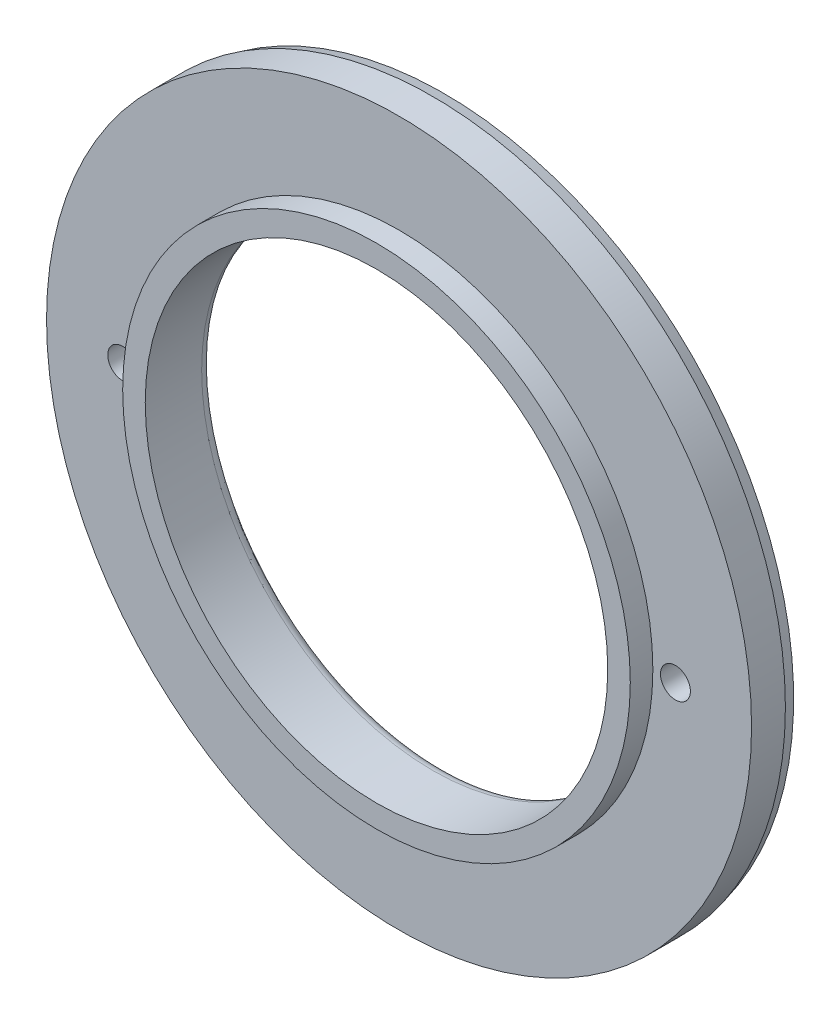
ISO-10303-21;
HEADER;
FILE_DESCRIPTION(('STEP AP214'),'2;1');
FILE_NAME('part.step','',(''),(''),'','','');
FILE_SCHEMA(('AUTOMOTIVE_DESIGN { 1 0 10303 214 1 1 1 1 }'));
ENDSEC;
DATA;
#1=APPLICATION_CONTEXT('core data for automotive mechanical design processes');
#2=APPLICATION_PROTOCOL_DEFINITION('international standard','automotive_design',2000,#1);
#3=PRODUCT_CONTEXT('',#1,'mechanical');
#4=PRODUCT('Part','Part','',(#3));
#5=PRODUCT_RELATED_PRODUCT_CATEGORY('part','',(#4));
#6=PRODUCT_DEFINITION_FORMATION('','',#4);
#7=PRODUCT_DEFINITION_CONTEXT('part definition',#1,'design');
#8=PRODUCT_DEFINITION('design','',#6,#7);
#9=PRODUCT_DEFINITION_SHAPE('','',#8);
#10=(LENGTH_UNIT() NAMED_UNIT(*) SI_UNIT(.MILLI.,.METRE.));
#11=(NAMED_UNIT(*) PLANE_ANGLE_UNIT() SI_UNIT($,.RADIAN.));
#12=(NAMED_UNIT(*) SI_UNIT($,.STERADIAN.) SOLID_ANGLE_UNIT());
#13=UNCERTAINTY_MEASURE_WITH_UNIT(LENGTH_MEASURE(1.E-05),#10,'distance_accuracy_value','');
#14=(GEOMETRIC_REPRESENTATION_CONTEXT(3) GLOBAL_UNCERTAINTY_ASSIGNED_CONTEXT((#13)) GLOBAL_UNIT_ASSIGNED_CONTEXT((#10,
#11,#12)) REPRESENTATION_CONTEXT('',''));
#15=CARTESIAN_POINT('',(0.,0.,0.));
#16=DIRECTION('',(0.,0.,1.));
#17=DIRECTION('',(1.,0.,0.));
#18=AXIS2_PLACEMENT_3D('',#15,#16,#17);
#19=CARTESIAN_POINT('',(0.,0.,16.));
#20=DIRECTION('',(0.,0.,-1.));
#21=DIRECTION('',(1.,0.,0.));
#22=AXIS2_PLACEMENT_3D('',#19,#20,#21);
#23=CYLINDRICAL_SURFACE('',#22,62.5);
#24=CARTESIAN_POINT('',(0.,0.,10.0000000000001));
#25=DIRECTION('',(0.,0.,-1.));
#26=DIRECTION('',(-1.,0.,0.));
#27=AXIS2_PLACEMENT_3D('',#24,#25,#26);
#28=CIRCLE('',#27,62.5);
#29=CARTESIAN_POINT('',(-62.5,0.,10.0000000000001));
#30=VERTEX_POINT('',#29);
#31=EDGE_CURVE('E36',#30,#30,#28,.T.);
#32=ORIENTED_EDGE('',*,*,#31,.F.);
#33=EDGE_LOOP('',(#32));
#34=FACE_BOUND('',#33,.T.);
#35=CARTESIAN_POINT('',(0.,0.,16.));
#36=DIRECTION('',(0.,0.,1.));
#37=DIRECTION('',(1.,0.,0.));
#38=AXIS2_PLACEMENT_3D('',#35,#36,#37);
#39=CIRCLE('',#38,62.5);
#40=CARTESIAN_POINT('',(62.5,0.,16.));
#41=VERTEX_POINT('',#40);
#42=EDGE_CURVE('E62',#41,#41,#39,.T.);
#43=ORIENTED_EDGE('',*,*,#42,.F.);
#44=EDGE_LOOP('',(#43));
#45=FACE_BOUND('',#44,.T.);
#46=ADVANCED_FACE('F24',(#34,#45),#23,.T.);
#47=CARTESIAN_POINT('',(0.,62.5,16.));
#48=DIRECTION('',(0.,0.,-1.));
#49=DIRECTION('',(1.,0.,0.));
#50=AXIS2_PLACEMENT_3D('',#47,#48,#49);
#51=PLANE('',#50);
#52=CARTESIAN_POINT('',(-49.,0.,16.));
#53=DIRECTION('',(0.,0.,1.));
#54=DIRECTION('',(1.,0.,0.));
#55=AXIS2_PLACEMENT_3D('',#52,#53,#54);
#56=CIRCLE('',#55,2.64999999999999);
#57=CARTESIAN_POINT('',(-46.35,0.,16.));
#58=VERTEX_POINT('',#57);
#59=EDGE_CURVE('E27',#58,#58,#56,.T.);
#60=ORIENTED_EDGE('',*,*,#59,.F.);
#61=EDGE_LOOP('',(#60));
#62=FACE_BOUND('',#61,.T.);
#63=CARTESIAN_POINT('',(49.,0.,16.));
#64=DIRECTION('',(0.,0.,1.));
#65=DIRECTION('',(1.,0.,0.));
#66=AXIS2_PLACEMENT_3D('',#63,#64,#65);
#67=CIRCLE('',#66,2.64999999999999);
#68=CARTESIAN_POINT('',(51.65,0.,16.));
#69=VERTEX_POINT('',#68);
#70=EDGE_CURVE('E39',#69,#69,#67,.T.);
#71=ORIENTED_EDGE('',*,*,#70,.F.);
#72=EDGE_LOOP('',(#71));
#73=FACE_BOUND('',#72,.T.);
#74=ORIENTED_EDGE('',*,*,#42,.T.);
#75=EDGE_LOOP('',(#74));
#76=FACE_BOUND('',#75,.T.);
#77=CARTESIAN_POINT('',(0.,0.,16.));
#78=DIRECTION('',(0.,0.,1.));
#79=DIRECTION('',(1.,0.,0.));
#80=AXIS2_PLACEMENT_3D('',#77,#78,#79);
#81=CIRCLE('',#80,45.);
#82=CARTESIAN_POINT('',(45.,0.,16.));
#83=VERTEX_POINT('',#82);
#84=EDGE_CURVE('E59',#83,#83,#81,.T.);
#85=ORIENTED_EDGE('',*,*,#84,.F.);
#86=EDGE_LOOP('',(#85));
#87=FACE_BOUND('',#86,.T.);
#88=ADVANCED_FACE('F75',(#62,#73,#76,#87),#51,.F.);
#89=CARTESIAN_POINT('',(0.,0.,16.));
#90=DIRECTION('',(0.,0.,-1.));
#91=DIRECTION('',(1.,0.,0.));
#92=AXIS2_PLACEMENT_3D('',#89,#90,#91);
#93=CYLINDRICAL_SURFACE('',#92,45.);
#94=ORIENTED_EDGE('',*,*,#84,.T.);
#95=EDGE_LOOP('',(#94));
#96=FACE_BOUND('',#95,.T.);
#97=CARTESIAN_POINT('',(0.,0.,20.));
#98=DIRECTION('',(0.,0.,1.));
#99=DIRECTION('',(1.,0.,0.));
#100=AXIS2_PLACEMENT_3D('',#97,#98,#99);
#101=CIRCLE('',#100,45.);
#102=CARTESIAN_POINT('',(45.,0.,20.));
#103=VERTEX_POINT('',#102);
#104=EDGE_CURVE('E46',#103,#103,#101,.T.);
#105=ORIENTED_EDGE('',*,*,#104,.F.);
#106=EDGE_LOOP('',(#105));
#107=FACE_BOUND('',#106,.T.);
#108=ADVANCED_FACE('F80',(#96,#107),#93,.T.);
#109=CARTESIAN_POINT('',(0.,41.,20.));
#110=DIRECTION('',(0.,0.,-1.));
#111=DIRECTION('',(1.,0.,0.));
#112=AXIS2_PLACEMENT_3D('',#109,#110,#111);
#113=PLANE('',#112);
#114=ORIENTED_EDGE('',*,*,#104,.T.);
#115=EDGE_LOOP('',(#114));
#116=FACE_BOUND('',#115,.T.);
#117=CARTESIAN_POINT('',(0.,0.,20.));
#118=DIRECTION('',(0.,0.,1.));
#119=DIRECTION('',(1.,0.,0.));
#120=AXIS2_PLACEMENT_3D('',#117,#118,#119);
#121=CIRCLE('',#120,41.);
#122=CARTESIAN_POINT('',(41.,0.,20.));
#123=VERTEX_POINT('',#122);
#124=EDGE_CURVE('E41',#123,#123,#121,.T.);
#125=ORIENTED_EDGE('',*,*,#124,.F.);
#126=EDGE_LOOP('',(#125));
#127=FACE_BOUND('',#126,.T.);
#128=ADVANCED_FACE('F86',(#116,#127),#113,.F.);
#129=CARTESIAN_POINT('',(0.,0.,16.));
#130=DIRECTION('',(0.,0.,-1.));
#131=DIRECTION('',(1.,0.,0.));
#132=AXIS2_PLACEMENT_3D('',#129,#130,#131);
#133=CYLINDRICAL_SURFACE('',#132,41.);
#134=CARTESIAN_POINT('',(0.,0.,10.));
#135=DIRECTION('',(0.,0.,-1.));
#136=DIRECTION('',(-1.,0.,0.));
#137=AXIS2_PLACEMENT_3D('',#134,#135,#136);
#138=CIRCLE('',#137,41.);
#139=CARTESIAN_POINT('',(-41.,0.,10.));
#140=VERTEX_POINT('',#139);
#141=EDGE_CURVE('E31',#140,#140,#138,.F.);
#142=ORIENTED_EDGE('',*,*,#141,.F.);
#143=EDGE_LOOP('',(#142));
#144=FACE_BOUND('',#143,.T.);
#145=ORIENTED_EDGE('',*,*,#124,.T.);
#146=EDGE_LOOP('',(#145));
#147=FACE_BOUND('',#146,.T.);
#148=ADVANCED_FACE('F92',(#144,#147),#133,.F.);
#149=CARTESIAN_POINT('',(0.,62.5,8.));
#150=DIRECTION('',(0.,0.,1.));
#151=DIRECTION('',(-1.,0.,0.));
#152=AXIS2_PLACEMENT_3D('',#149,#150,#151);
#153=PLANE('',#152);
#154=CARTESIAN_POINT('',(-49.,0.,8.));
#155=DIRECTION('',(0.,0.,1.));
#156=DIRECTION('',(1.,0.,0.));
#157=AXIS2_PLACEMENT_3D('',#154,#155,#156);
#158=CIRCLE('',#157,5.2);
#159=CARTESIAN_POINT('',(-43.8,0.,8.));
#160=VERTEX_POINT('',#159);
#161=EDGE_CURVE('E135',#160,#160,#158,.T.);
#162=ORIENTED_EDGE('',*,*,#161,.T.);
#163=EDGE_LOOP('',(#162));
#164=FACE_BOUND('',#163,.T.);
#165=CARTESIAN_POINT('',(49.,0.,8.));
#166=DIRECTION('',(0.,0.,1.));
#167=DIRECTION('',(1.,0.,0.));
#168=AXIS2_PLACEMENT_3D('',#165,#166,#167);
#169=CIRCLE('',#168,5.2);
#170=CARTESIAN_POINT('',(54.2,0.,8.));
#171=VERTEX_POINT('',#170);
#172=EDGE_CURVE('E42',#171,#171,#169,.T.);
#173=ORIENTED_EDGE('',*,*,#172,.T.);
#174=EDGE_LOOP('',(#173));
#175=FACE_BOUND('',#174,.T.);
#176=CARTESIAN_POINT('',(0.,0.,8.));
#177=DIRECTION('',(0.,0.,-1.));
#178=DIRECTION('',(-1.,0.,0.));
#179=AXIS2_PLACEMENT_3D('',#176,#177,#178);
#180=CIRCLE('',#179,43.);
#181=CARTESIAN_POINT('',(-43.,0.,8.));
#182=VERTEX_POINT('',#181);
#183=EDGE_CURVE('E10',#182,#182,#180,.T.);
#184=ORIENTED_EDGE('',*,*,#183,.F.);
#185=EDGE_LOOP('',(#184));
#186=FACE_BOUND('',#185,.T.);
#187=CARTESIAN_POINT('',(0.,0.,8.));
#188=DIRECTION('',(0.,0.,-1.));
#189=DIRECTION('',(-1.,0.,0.));
#190=AXIS2_PLACEMENT_3D('',#187,#188,#189);
#191=CIRCLE('',#190,61.9641016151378);
#192=CARTESIAN_POINT('',(-61.9641016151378,0.,8.));
#193=VERTEX_POINT('',#192);
#194=EDGE_CURVE('E65',#193,#193,#191,.F.);
#195=ORIENTED_EDGE('',*,*,#194,.F.);
#196=EDGE_LOOP('',(#195));
#197=FACE_BOUND('',#196,.T.);
#198=ADVANCED_FACE('F97',(#164,#175,#186,#197),#153,.F.);
#199=CARTESIAN_POINT('',(0.,0.,8.));
#200=DIRECTION('',(0.,0.,1.));
#201=DIRECTION('',(-1.,0.,0.));
#202=AXIS2_PLACEMENT_3D('',#199,#200,#201);
#203=CONICAL_SURFACE('',#202,61.9641016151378,0.261799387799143);
#204=ORIENTED_EDGE('',*,*,#31,.T.);
#205=EDGE_LOOP('',(#204));
#206=FACE_BOUND('',#205,.T.);
#207=ORIENTED_EDGE('',*,*,#194,.T.);
#208=EDGE_LOOP('',(#207));
#209=FACE_BOUND('',#208,.T.);
#210=ADVANCED_FACE('F70',(#206,#209),#203,.T.);
#211=CARTESIAN_POINT('',(0.,0.,10.));
#212=DIRECTION('',(0.,0.,1.));
#213=DIRECTION('',(-1.,0.,0.));
#214=AXIS2_PLACEMENT_3D('',#211,#212,#213);
#215=TOROIDAL_SURFACE('',#214,43.,2.);
#216=ORIENTED_EDGE('',*,*,#183,.T.);
#217=EDGE_LOOP('',(#216));
#218=FACE_BOUND('',#217,.T.);
#219=ORIENTED_EDGE('',*,*,#141,.T.);
#220=EDGE_LOOP('',(#219));
#221=FACE_BOUND('',#220,.T.);
#222=ADVANCED_FACE('F109',(#218,#221),#215,.T.);
#223=CARTESIAN_POINT('',(49.,0.,8.));
#224=DIRECTION('',(0.,0.,-1.));
#225=DIRECTION('',(1.,0.,0.));
#226=AXIS2_PLACEMENT_3D('',#223,#224,#225);
#227=CYLINDRICAL_SURFACE('',#226,2.64999999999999);
#228=CARTESIAN_POINT('',(49.,0.,10.55));
#229=DIRECTION('',(0.,0.,1.));
#230=DIRECTION('',(1.,0.,0.));
#231=AXIS2_PLACEMENT_3D('',#228,#229,#230);
#232=CIRCLE('',#231,2.64999999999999);
#233=CARTESIAN_POINT('',(51.65,0.,10.55));
#234=VERTEX_POINT('',#233);
#235=EDGE_CURVE('E49',#234,#234,#232,.T.);
#236=ORIENTED_EDGE('',*,*,#235,.F.);
#237=EDGE_LOOP('',(#236));
#238=FACE_BOUND('',#237,.T.);
#239=ORIENTED_EDGE('',*,*,#70,.T.);
#240=EDGE_LOOP('',(#239));
#241=FACE_BOUND('',#240,.T.);
#242=ADVANCED_FACE('F112',(#238,#241),#227,.F.);
#243=CARTESIAN_POINT('',(49.,0.,8.));
#244=DIRECTION('',(0.,0.,-1.));
#245=DIRECTION('',(1.,0.,0.));
#246=AXIS2_PLACEMENT_3D('',#243,#244,#245);
#247=CONICAL_SURFACE('',#246,5.2,0.785398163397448);
#248=ORIENTED_EDGE('',*,*,#235,.T.);
#249=EDGE_LOOP('',(#248));
#250=FACE_BOUND('',#249,.T.);
#251=ORIENTED_EDGE('',*,*,#172,.F.);
#252=EDGE_LOOP('',(#251));
#253=FACE_BOUND('',#252,.T.);
#254=ADVANCED_FACE('F113',(#250,#253),#247,.F.);
#255=CARTESIAN_POINT('',(-49.,0.,8.));
#256=DIRECTION('',(0.,0.,-1.));
#257=DIRECTION('',(1.,0.,0.));
#258=AXIS2_PLACEMENT_3D('',#255,#256,#257);
#259=CYLINDRICAL_SURFACE('',#258,2.64999999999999);
#260=CARTESIAN_POINT('',(-49.,0.,10.55));
#261=DIRECTION('',(0.,0.,1.));
#262=DIRECTION('',(1.,0.,0.));
#263=AXIS2_PLACEMENT_3D('',#260,#261,#262);
#264=CIRCLE('',#263,2.64999999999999);
#265=CARTESIAN_POINT('',(-46.35,0.,10.55));
#266=VERTEX_POINT('',#265);
#267=EDGE_CURVE('E132',#266,#266,#264,.T.);
#268=ORIENTED_EDGE('',*,*,#267,.F.);
#269=EDGE_LOOP('',(#268));
#270=FACE_BOUND('',#269,.T.);
#271=ORIENTED_EDGE('',*,*,#59,.T.);
#272=EDGE_LOOP('',(#271));
#273=FACE_BOUND('',#272,.T.);
#274=ADVANCED_FACE('F116',(#270,#273),#259,.F.);
#275=CARTESIAN_POINT('',(-49.,0.,8.));
#276=DIRECTION('',(0.,0.,-1.));
#277=DIRECTION('',(1.,0.,0.));
#278=AXIS2_PLACEMENT_3D('',#275,#276,#277);
#279=CONICAL_SURFACE('',#278,5.2,0.785398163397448);
#280=ORIENTED_EDGE('',*,*,#267,.T.);
#281=EDGE_LOOP('',(#280));
#282=FACE_BOUND('',#281,.T.);
#283=ORIENTED_EDGE('',*,*,#161,.F.);
#284=EDGE_LOOP('',(#283));
#285=FACE_BOUND('',#284,.T.);
#286=ADVANCED_FACE('F121',(#282,#285),#279,.F.);
#287=CLOSED_SHELL('',(#46,#88,#108,#128,#148,#198,#210,#222,#242,#254,#274,#286));
#288=MANIFOLD_SOLID_BREP('B2',#287);
#289=ADVANCED_BREP_SHAPE_REPRESENTATION('',(#18,#288),#14);
#290=SHAPE_DEFINITION_REPRESENTATION(#9,#289);
ENDSEC;
END-ISO-10303-21;
